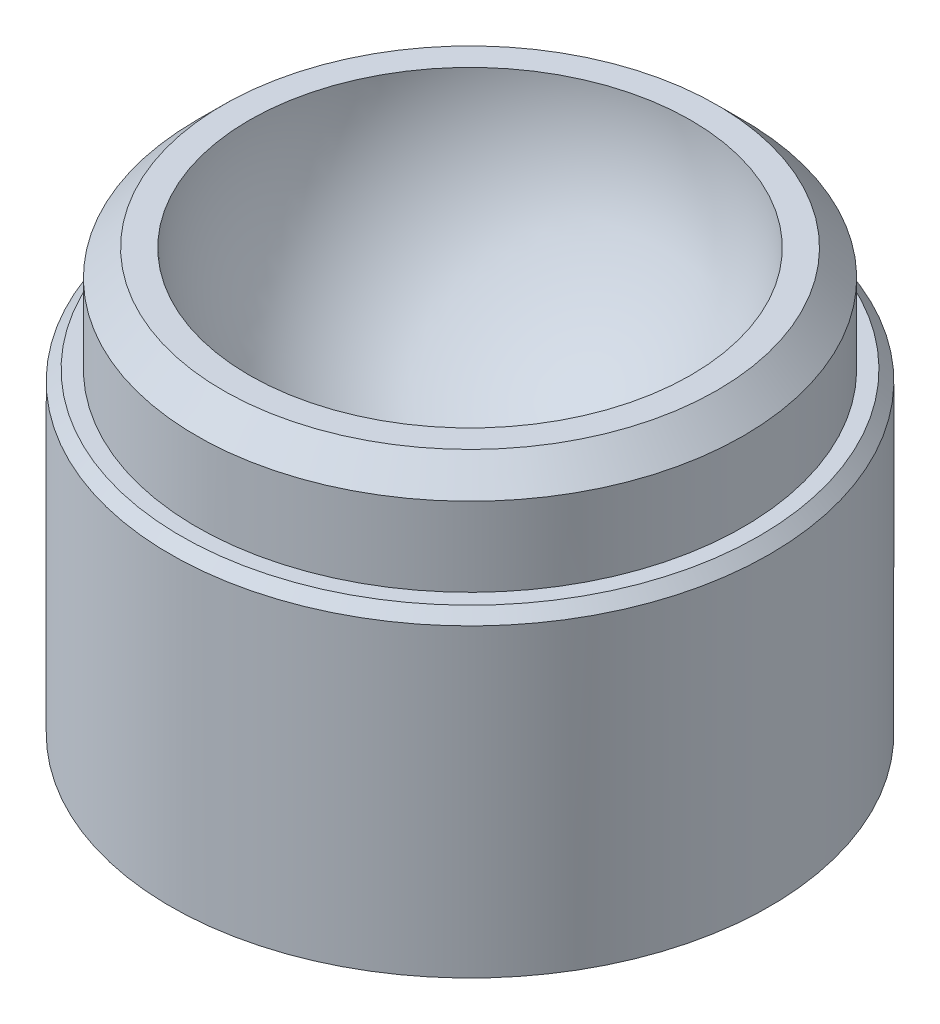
ISO-10303-21;
HEADER;
FILE_DESCRIPTION(('STEP AP214'),'2;1');
FILE_NAME('part.step','',(''),(''),'','','');
FILE_SCHEMA(('AUTOMOTIVE_DESIGN { 1 0 10303 214 1 1 1 1 }'));
ENDSEC;
DATA;
#1=APPLICATION_CONTEXT('core data for automotive mechanical design processes');
#2=APPLICATION_PROTOCOL_DEFINITION('international standard','automotive_design',2000,#1);
#3=PRODUCT_CONTEXT('',#1,'mechanical');
#4=PRODUCT('Part','Part','',(#3));
#5=PRODUCT_RELATED_PRODUCT_CATEGORY('part','',(#4));
#6=PRODUCT_DEFINITION_FORMATION('','',#4);
#7=PRODUCT_DEFINITION_CONTEXT('part definition',#1,'design');
#8=PRODUCT_DEFINITION('design','',#6,#7);
#9=PRODUCT_DEFINITION_SHAPE('','',#8);
#10=(LENGTH_UNIT() NAMED_UNIT(*) SI_UNIT(.MILLI.,.METRE.));
#11=(NAMED_UNIT(*) PLANE_ANGLE_UNIT() SI_UNIT($,.RADIAN.));
#12=(NAMED_UNIT(*) SI_UNIT($,.STERADIAN.) SOLID_ANGLE_UNIT());
#13=UNCERTAINTY_MEASURE_WITH_UNIT(LENGTH_MEASURE(1.E-05),#10,'distance_accuracy_value','');
#14=(GEOMETRIC_REPRESENTATION_CONTEXT(3) GLOBAL_UNCERTAINTY_ASSIGNED_CONTEXT((#13)) GLOBAL_UNIT_ASSIGNED_CONTEXT((#10,
#11,#12)) REPRESENTATION_CONTEXT('',''));
#15=CARTESIAN_POINT('',(0.,0.,0.));
#16=DIRECTION('',(0.,0.,1.));
#17=DIRECTION('',(1.,0.,0.));
#18=AXIS2_PLACEMENT_3D('',#15,#16,#17);
#19=CARTESIAN_POINT('',(5.19999999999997,-4.,0.));
#20=DIRECTION('',(0.,-1.,0.));
#21=DIRECTION('',(1.,0.,0.));
#22=AXIS2_PLACEMENT_3D('',#19,#20,#21);
#23=PLANE('',#22);
#24=CARTESIAN_POINT('',(0.,-4.,0.));
#25=DIRECTION('',(0.,-1.,0.));
#26=DIRECTION('',(1.,0.,0.));
#27=AXIS2_PLACEMENT_3D('',#24,#25,#26);
#28=CIRCLE('',#27,5.49999999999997);
#29=CARTESIAN_POINT('',(5.49999999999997,-4.,0.));
#30=VERTEX_POINT('',#29);
#31=EDGE_CURVE('E31',#30,#30,#28,.F.);
#32=ORIENTED_EDGE('',*,*,#31,.T.);
#33=EDGE_LOOP('',(#32));
#34=FACE_BOUND('',#33,.T.);
#35=CARTESIAN_POINT('',(0.,-4.,0.));
#36=DIRECTION('',(0.,1.,0.));
#37=DIRECTION('',(-1.,0.,0.));
#38=AXIS2_PLACEMENT_3D('',#35,#36,#37);
#39=CIRCLE('',#38,5.19999999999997);
#40=CARTESIAN_POINT('',(-5.19999999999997,-4.,0.));
#41=VERTEX_POINT('',#40);
#42=EDGE_CURVE('E44',#41,#41,#39,.T.);
#43=ORIENTED_EDGE('',*,*,#42,.F.);
#44=EDGE_LOOP('',(#43));
#45=FACE_BOUND('',#44,.T.);
#46=ADVANCED_FACE('F25',(#34,#45),#23,.F.);
#47=CARTESIAN_POINT('',(0.,-6.19999999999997,0.));
#48=DIRECTION('',(0.,1.,0.));
#49=DIRECTION('',(-1.,0.,0.));
#50=AXIS2_PLACEMENT_3D('',#47,#48,#49);
#51=CYLINDRICAL_SURFACE('',#50,5.19999999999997);
#52=CARTESIAN_POINT('',(0.,-2.5,0.));
#53=DIRECTION('',(0.,-1.,0.));
#54=DIRECTION('',(1.,0.,0.));
#55=AXIS2_PLACEMENT_3D('',#52,#53,#54);
#56=CIRCLE('',#55,5.19999999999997);
#57=CARTESIAN_POINT('',(5.19999999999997,-2.5,0.));
#58=VERTEX_POINT('',#57);
#59=EDGE_CURVE('E35',#58,#58,#56,.T.);
#60=ORIENTED_EDGE('',*,*,#59,.T.);
#61=EDGE_LOOP('',(#60));
#62=FACE_BOUND('',#61,.T.);
#63=ORIENTED_EDGE('',*,*,#42,.T.);
#64=EDGE_LOOP('',(#63));
#65=FACE_BOUND('',#64,.T.);
#66=ADVANCED_FACE('F71',(#62,#65),#51,.T.);
#67=CARTESIAN_POINT('',(4.19999999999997,-2.,0.));
#68=DIRECTION('',(0.,-1.,0.));
#69=DIRECTION('',(1.,0.,0.));
#70=AXIS2_PLACEMENT_3D('',#67,#68,#69);
#71=PLANE('',#70);
#72=CARTESIAN_POINT('',(0.,-2.,0.));
#73=DIRECTION('',(0.,-1.,0.));
#74=DIRECTION('',(1.,0.,0.));
#75=AXIS2_PLACEMENT_3D('',#72,#73,#74);
#76=CIRCLE('',#75,4.69999999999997);
#77=CARTESIAN_POINT('',(4.69999999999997,-2.,0.));
#78=VERTEX_POINT('',#77);
#79=EDGE_CURVE('E39',#78,#78,#76,.F.);
#80=ORIENTED_EDGE('',*,*,#79,.T.);
#81=EDGE_LOOP('',(#80));
#82=FACE_BOUND('',#81,.T.);
#83=CARTESIAN_POINT('',(0.,-2.,0.));
#84=DIRECTION('',(0.,1.,0.));
#85=DIRECTION('',(-1.,0.,0.));
#86=AXIS2_PLACEMENT_3D('',#83,#84,#85);
#87=CIRCLE('',#86,4.19999999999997);
#88=CARTESIAN_POINT('',(-4.19999999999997,-2.,0.));
#89=VERTEX_POINT('',#88);
#90=EDGE_CURVE('E47',#89,#89,#87,.T.);
#91=ORIENTED_EDGE('',*,*,#90,.F.);
#92=EDGE_LOOP('',(#91));
#93=FACE_BOUND('',#92,.T.);
#94=ADVANCED_FACE('F67',(#82,#93),#71,.F.);
#95=CARTESIAN_POINT('',(0.,-2.,0.));
#96=DIRECTION('',(0.,1.,0.));
#97=DIRECTION('',(1.,0.,0.));
#98=AXIS2_PLACEMENT_3D('',#95,#96,#97);
#99=SPHERICAL_SURFACE('',#98,4.19999999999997);
#100=ORIENTED_EDGE('',*,*,#90,.T.);
#101=EDGE_LOOP('',(#100));
#102=FACE_BOUND('',#101,.T.);
#103=ADVANCED_FACE('F58',(#102),#99,.F.);
#104=CARTESIAN_POINT('',(5.69999999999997,-10.,0.));
#105=DIRECTION('',(0.,1.,0.));
#106=DIRECTION('',(-1.,0.,0.));
#107=AXIS2_PLACEMENT_3D('',#104,#105,#106);
#108=PLANE('',#107);
#109=CARTESIAN_POINT('',(0.,-10.,0.));
#110=DIRECTION('',(0.,1.,0.));
#111=DIRECTION('',(-1.,0.,0.));
#112=AXIS2_PLACEMENT_3D('',#109,#110,#111);
#113=CIRCLE('',#112,5.69999999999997);
#114=CARTESIAN_POINT('',(-5.69999999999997,-10.,0.));
#115=VERTEX_POINT('',#114);
#116=EDGE_CURVE('E50',#115,#115,#113,.T.);
#117=ORIENTED_EDGE('',*,*,#116,.F.);
#118=EDGE_LOOP('',(#117));
#119=FACE_BOUND('',#118,.T.);
#120=ADVANCED_FACE('F56',(#119),#108,.F.);
#121=CARTESIAN_POINT('',(0.,-6.19999999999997,0.));
#122=DIRECTION('',(0.,1.,0.));
#123=DIRECTION('',(-1.,0.,0.));
#124=AXIS2_PLACEMENT_3D('',#121,#122,#123);
#125=CYLINDRICAL_SURFACE('',#124,5.69999999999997);
#126=CARTESIAN_POINT('',(0.,-4.2,0.));
#127=DIRECTION('',(0.,-1.,0.));
#128=DIRECTION('',(1.,0.,0.));
#129=AXIS2_PLACEMENT_3D('',#126,#127,#128);
#130=CIRCLE('',#129,5.69999999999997);
#131=CARTESIAN_POINT('',(5.69999999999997,-4.2,0.));
#132=VERTEX_POINT('',#131);
#133=EDGE_CURVE('E10',#132,#132,#130,.T.);
#134=ORIENTED_EDGE('',*,*,#133,.T.);
#135=EDGE_LOOP('',(#134));
#136=FACE_BOUND('',#135,.T.);
#137=ORIENTED_EDGE('',*,*,#116,.T.);
#138=EDGE_LOOP('',(#137));
#139=FACE_BOUND('',#138,.T.);
#140=ADVANCED_FACE('F54',(#136,#139),#125,.T.);
#141=CARTESIAN_POINT('',(0.,-2.,0.));
#142=DIRECTION('',(0.,-1.,0.));
#143=DIRECTION('',(1.,0.,0.));
#144=AXIS2_PLACEMENT_3D('',#141,#142,#143);
#145=CONICAL_SURFACE('',#144,4.69999999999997,0.785398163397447);
#146=ORIENTED_EDGE('',*,*,#59,.F.);
#147=EDGE_LOOP('',(#146));
#148=FACE_BOUND('',#147,.T.);
#149=ORIENTED_EDGE('',*,*,#79,.F.);
#150=EDGE_LOOP('',(#149));
#151=FACE_BOUND('',#150,.T.);
#152=ADVANCED_FACE('F65',(#148,#151),#145,.T.);
#153=CARTESIAN_POINT('',(0.,-4.,0.));
#154=DIRECTION('',(0.,-1.,0.));
#155=DIRECTION('',(1.,0.,0.));
#156=AXIS2_PLACEMENT_3D('',#153,#154,#155);
#157=CONICAL_SURFACE('',#156,5.49999999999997,0.785398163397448);
#158=ORIENTED_EDGE('',*,*,#133,.F.);
#159=EDGE_LOOP('',(#158));
#160=FACE_BOUND('',#159,.T.);
#161=ORIENTED_EDGE('',*,*,#31,.F.);
#162=EDGE_LOOP('',(#161));
#163=FACE_BOUND('',#162,.T.);
#164=ADVANCED_FACE('F87',(#160,#163),#157,.T.);
#165=CLOSED_SHELL('',(#46,#66,#94,#103,#120,#140,#152,#164));
#166=MANIFOLD_SOLID_BREP('B2',#165);
#167=ADVANCED_BREP_SHAPE_REPRESENTATION('',(#18,#166),#14);
#168=SHAPE_DEFINITION_REPRESENTATION(#9,#167);
ENDSEC;
END-ISO-10303-21;
